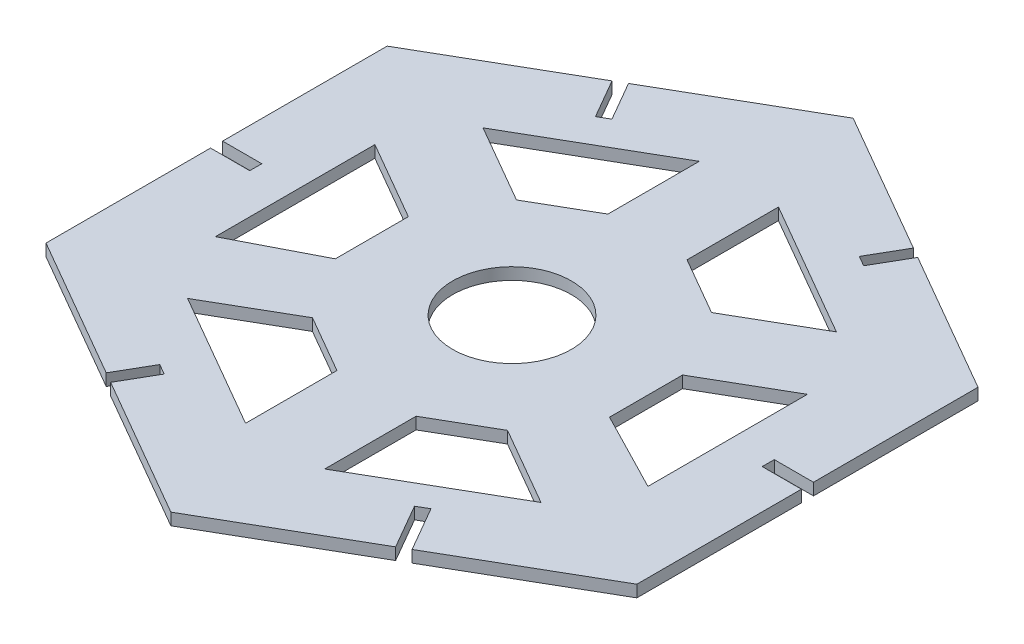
from build123d import *

# Parameters (mm, degrees)
BOSS_EXTRUDE2_DEPTH = 3
BOSS_EXTRUDE3_DEPTH = 3
SKETCH3_R           = 15
CUT_EXTRUDE1_DEPTH  = 3


with BuildPart() as part:
    # Sketch1 → Boss-Extrude2 (new body)
    with BuildSketch(Plane(origin=(0, 0, 0), x_dir=(1, 0, 0), z_dir=(0, 1, 0))):
        Polygon((-34.641016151, -17.859010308), (0, -37.859010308), (34.641016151, -17.859010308), (34.641016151, 22.140989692), (0, 42.140989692), (-34.641016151, 22.140989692), align=None)
        Polygon((-24.641016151, 27.914492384), (-44.641016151, 39.461497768), (-54.641016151, 33.687995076), (-54.641016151, 22.140989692), (-34.641016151, 10.593984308), (-34.641016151, 22.140989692), align=None)
        Polygon((-10, -32.085507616), (-10, -55.179518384), (0, -60.953021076), (10, -55.179518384), (10, -32.085507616), (0, -37.859010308), align=None)
        Polygon((-34.641016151, -7.859010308), (-54.641016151, -18.15802025), (-54.641016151, -29.406015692), (-44.641016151, -35.179518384), (-24.641016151, -23.632513), (-34.641016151, -17.859010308), align=None)
        Polygon((54.641016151, -29.406015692), (54.641016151, -18.15802025), (34.641016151, -7.859010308), (34.641016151, -17.859010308), (24.641016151, -23.632513), (44.641016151, -35.179518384), align=None)
        Polygon((54.641016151, 33.687995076), (44.641016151, 39.461497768), (24.641016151, 27.914492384), (34.641016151, 22.140989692), (34.641016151, 10.593984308), (54.641016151, 22.140989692), align=None)
        Polygon((10, 59.461497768), (0, 65.23500046), (-10, 59.461497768), (-10, 36.367487), (0, 42.140989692), (10, 36.367487), align=None)
    extrude(amount=BOSS_EXTRUDE2_DEPTH)

    # Sketch2 → Boss-Extrude3 (add)
    with BuildSketch(Plane(origin=(0, 3, 0), x_dir=(1, 0, 0), z_dir=(0, 1, 0))):
        Polygon((-36.00068536, -63.262026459), (0, -84.047031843), (36.00068536, -63.262026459), (29.484638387, -51.975902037), (32.124283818, -50.451902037), (38.640330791, -61.738026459), (74.641016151, -40.953021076), (74.641016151, 0.616989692), (64.735016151, 0.616989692), (64.735016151, 3.664989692), (74.641016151, 3.664989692), (74.641016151, 45.23500046), (38.619546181, 66.032005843), (33.619546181, 57.371751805), (31.02146997, 58.871751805), (36.02146997, 67.532005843), (0, 88.329011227), (-35.979900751, 67.556005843), (-30.260668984, 57.650005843), (-32.900314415, 56.126005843), (-38.619546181, 66.032005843), (-74.641016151, 45.23500046), (-74.641016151, 3.664989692), (-64.735016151, 3.664989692), (-64.735016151, 0.616989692), (-74.641016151, 0.616989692), (-74.641016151, -40.953021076), (-38.640330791, -61.738026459), (-33.687330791, -53.15917881), (-31.04768536, -54.68317881), align=None)
        Polygon((10, -55.179518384), (0, -60.953021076), (-10, -55.179518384), (-44.641016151, -35.179518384), (-54.641016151, -29.406015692), (-54.641016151, -18.15802025), (-54.641016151, 22.140989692), (-54.641016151, 33.687995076), (-44.641016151, 39.461497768), (-10, 59.461497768), (0, 65.23500046), (10, 59.461497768), (44.641016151, 39.461497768), (54.641016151, 33.687995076), (54.641016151, 22.140989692), (54.641016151, -18.15802025), (54.641016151, -29.406015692), (44.641016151, -35.179518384), align=None, mode=Mode.SUBTRACT)
    extrude(amount=-BOSS_EXTRUDE3_DEPTH)

    # Sketch3 → Cut-Extrude1 (cut)
    with BuildSketch(Plane(origin=(0, 3, 0), x_dir=(1, 0, 0), z_dir=(0, 1, 0))):
        with Locations(Location((0, 2.140989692, 0), (0, 0, 270))):
            Circle(SKETCH3_R)
    extrude(amount=-CUT_EXTRUDE1_DEPTH, mode=Mode.SUBTRACT)


solid = part.part
